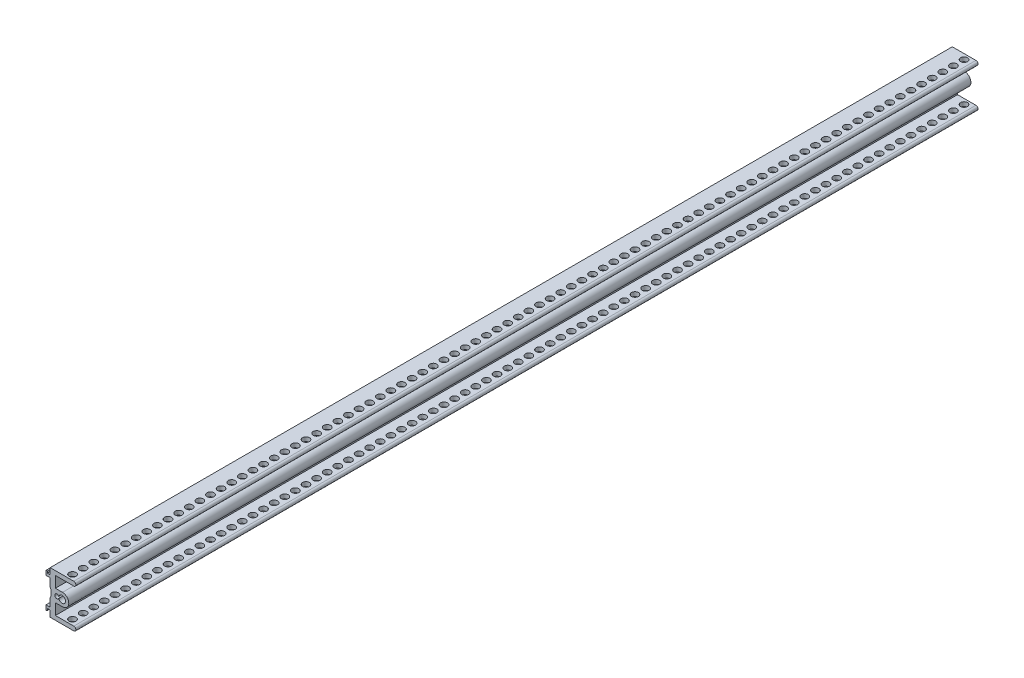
from build123d import *

# Parameters (mm, degrees)
EXTRUDE_1_DEPTH     = 215.9
SKETCH_3_R          = 1.65
CUT_EXTRUDE_1_DEPTH = 2.5


with BuildPart() as part:
    # Sketch 1 → Extrude 1 (new, symmetric)
    with BuildSketch(Plane.XY):
        with BuildLine():
            Line((-4.15, 8.3), (-4.15, 3))
            Line((-4.15, 3), (-0.75, 3))
            ThreePointArc((-0.75, 3), (2.25, 0), (-0.75, -3))
            Line((-0.75, -3), (-4.15, -3))
            Line((-4.15, -3), (-4.15, -8.3))
            Line((-4.15, -8.3), (4.65, -8.3))
            ThreePointArc((4.65, -8.3), (5.65, -9.3), (4.65, -10.3))
            Line((4.65, -10.3), (-6.65, -10.3))
            Line((-6.65, -10.3), (-6.65, -7.3))
            Line((-6.65, -7.3), (-8.05, -7.3))
            Line((-8.05, -7.3), (-8.05, -8.078245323))
            ThreePointArc((-8.05, -8.078245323), (-8.35, -8.378245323), (-8.65, -8.078245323))
            Line((-8.65, -8.078245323), (-8.65, -6.1))
            Line((-8.65, -6.1), (-6.65, -6.1))
            Line((-6.65, -6.1), (-6.65, -2.088438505))
            Line((-6.65, -2.088438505), (-6.35, -1.488438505))
            Line((-6.35, -1.488438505), (-6.35, 1.511561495))
            Line((-6.35, 1.511561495), (-6.65, 2.111561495))
            Line((-6.65, 2.111561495), (-6.65, 6.1))
            Line((-6.65, 6.1), (-8.65, 6.1))
            Line((-8.65, 6.1), (-8.65, 8.078245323))
            ThreePointArc((-8.65, 8.078245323), (-8.35, 8.378245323), (-8.05, 8.078245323))
            Line((-8.05, 8.078245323), (-8.05, 7.3))
            Line((-8.05, 7.3), (-6.65, 7.3))
            Line((-6.65, 7.3), (-6.65, 10.3))
            Line((-6.65, 10.3), (4.65, 10.3))
            ThreePointArc((4.65, 10.3), (5.65, 9.3), (4.65, 8.3))
            Line((4.65, 8.3), (-4.15, 8.3))
        make_face()
        with BuildLine():
            ThreePointArc((-2.5445, -0.424346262), (0.7, 0), (-2.5445, 0.424346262))
            ThreePointArc((-2.5445, 0.424346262), (-4.45, 0), (-2.5445, -0.424346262))
        make_face(mode=Mode.SUBTRACT)
    extrude(amount=EXTRUDE_1_DEPTH, both=True)

    # Sketch 3 → Cut-Extrude 1 (cut)
    with BuildSketch(Plane.XZ.offset(10.3)):
        with Locations((1.5, 213.36)):
            Circle(SKETCH_3_R)
        with Locations((1.5, 208.28)):
            Circle(SKETCH_3_R)
        with Locations((1.5, 203.2)):
            Circle(SKETCH_3_R)
        with Locations((1.5, 198.12)):
            Circle(SKETCH_3_R)
        with Locations((1.5, 193.04)):
            Circle(SKETCH_3_R)
        with Locations((1.5, 187.96)):
            Circle(SKETCH_3_R)
        with Locations((1.5, 182.88)):
            Circle(SKETCH_3_R)
        with Locations((1.5, 177.8)):
            Circle(SKETCH_3_R)
        with Locations((1.5, 172.72)):
            Circle(SKETCH_3_R)
        with Locations((1.5, 167.64)):
            Circle(SKETCH_3_R)
        with Locations((1.5, 162.56)):
            Circle(SKETCH_3_R)
        with Locations((1.5, 157.48)):
            Circle(SKETCH_3_R)
        with Locations((1.5, 152.4)):
            Circle(SKETCH_3_R)
        with Locations((1.5, 147.32)):
            Circle(SKETCH_3_R)
        with Locations((1.5, 142.24)):
            Circle(SKETCH_3_R)
        with Locations((1.5, 137.16)):
            Circle(SKETCH_3_R)
        with Locations((1.5, 132.08)):
            Circle(SKETCH_3_R)
        with Locations((1.5, 127)):
            Circle(SKETCH_3_R)
        with Locations((1.5, 121.92)):
            Circle(SKETCH_3_R)
        with Locations((1.5, 116.84)):
            Circle(SKETCH_3_R)
        with Locations((1.5, 111.76)):
            Circle(SKETCH_3_R)
        with Locations((1.5, 106.68)):
            Circle(SKETCH_3_R)
        with Locations((1.5, 101.6)):
            Circle(SKETCH_3_R)
        with Locations((1.5, 96.52)):
            Circle(SKETCH_3_R)
        with Locations((1.5, 91.44)):
            Circle(SKETCH_3_R)
        with Locations((1.5, 86.36)):
            Circle(SKETCH_3_R)
        with Locations((1.5, 81.28)):
            Circle(SKETCH_3_R)
        with Locations((1.5, 76.2)):
            Circle(SKETCH_3_R)
        with Locations((1.5, 71.12)):
            Circle(SKETCH_3_R)
        with Locations((1.5, 66.04)):
            Circle(SKETCH_3_R)
        with Locations((1.5, 60.96)):
            Circle(SKETCH_3_R)
        with Locations((1.5, 55.88)):
            Circle(SKETCH_3_R)
        with Locations((1.5, 50.8)):
            Circle(SKETCH_3_R)
        with Locations((1.5, 45.72)):
            Circle(SKETCH_3_R)
        with Locations((1.5, 40.64)):
            Circle(SKETCH_3_R)
        with Locations((1.5, 35.56)):
            Circle(SKETCH_3_R)
        with Locations((1.5, 30.48)):
            Circle(SKETCH_3_R)
        with Locations((1.5, 25.4)):
            Circle(SKETCH_3_R)
        with Locations((1.5, 20.32)):
            Circle(SKETCH_3_R)
        with Locations((1.5, 15.24)):
            Circle(SKETCH_3_R)
        with Locations((1.5, 10.16)):
            Circle(SKETCH_3_R)
        with Locations((1.5, 5.08)):
            Circle(SKETCH_3_R)
        with Locations((1.5, 0)):
            Circle(SKETCH_3_R)
        with Locations((1.5, -5.08)):
            Circle(SKETCH_3_R)
        with Locations((1.5, -10.16)):
            Circle(SKETCH_3_R)
        with Locations((1.5, -15.24)):
            Circle(SKETCH_3_R)
        with Locations((1.5, -20.32)):
            Circle(SKETCH_3_R)
        with Locations((1.5, -25.4)):
            Circle(SKETCH_3_R)
        with Locations((1.5, -30.48)):
            Circle(SKETCH_3_R)
        with Locations((1.5, -35.56)):
            Circle(SKETCH_3_R)
        with Locations((1.5, -40.64)):
            Circle(SKETCH_3_R)
        with Locations((1.5, -45.72)):
            Circle(SKETCH_3_R)
        with Locations((1.5, -50.8)):
            Circle(SKETCH_3_R)
        with Locations((1.5, -55.88)):
            Circle(SKETCH_3_R)
        with Locations((1.5, -60.96)):
            Circle(SKETCH_3_R)
        with Locations((1.5, -66.04)):
            Circle(SKETCH_3_R)
        with Locations((1.5, -71.12)):
            Circle(SKETCH_3_R)
        with Locations((1.5, -76.2)):
            Circle(SKETCH_3_R)
        with Locations((1.5, -81.28)):
            Circle(SKETCH_3_R)
        with Locations((1.5, -86.36)):
            Circle(SKETCH_3_R)
        with Locations((1.5, -91.44)):
            Circle(SKETCH_3_R)
        with Locations((1.5, -96.52)):
            Circle(SKETCH_3_R)
        with Locations((1.5, -101.6)):
            Circle(SKETCH_3_R)
        with Locations((1.5, -106.68)):
            Circle(SKETCH_3_R)
        with Locations((1.5, -111.76)):
            Circle(SKETCH_3_R)
        with Locations((1.5, -116.84)):
            Circle(SKETCH_3_R)
        with Locations((1.5, -121.92)):
            Circle(SKETCH_3_R)
        with Locations((1.5, -127)):
            Circle(SKETCH_3_R)
        with Locations((1.5, -132.08)):
            Circle(SKETCH_3_R)
        with Locations((1.5, -137.16)):
            Circle(SKETCH_3_R)
        with Locations((1.5, -142.24)):
            Circle(SKETCH_3_R)
        with Locations((1.5, -147.32)):
            Circle(SKETCH_3_R)
        with Locations((1.5, -152.4)):
            Circle(SKETCH_3_R)
        with Locations((1.5, -157.48)):
            Circle(SKETCH_3_R)
        with Locations((1.5, -162.56)):
            Circle(SKETCH_3_R)
        with Locations((1.5, -167.64)):
            Circle(SKETCH_3_R)
        with Locations((1.5, -172.72)):
            Circle(SKETCH_3_R)
        with Locations((1.5, -177.8)):
            Circle(SKETCH_3_R)
        with Locations((1.5, -182.88)):
            Circle(SKETCH_3_R)
        with Locations((1.5, -187.96)):
            Circle(SKETCH_3_R)
        with Locations((1.5, -193.04)):
            Circle(SKETCH_3_R)
        with Locations((1.5, -198.12)):
            Circle(SKETCH_3_R)
        with Locations((1.5, -203.2)):
            Circle(SKETCH_3_R)
        with Locations((1.5, -208.28)):
            Circle(SKETCH_3_R)
        with Locations((1.5, -213.36)):
            Circle(SKETCH_3_R)
    cut_extrude_1 = extrude(amount=-CUT_EXTRUDE_1_DEPTH, mode=Mode.SUBTRACT)

    # Mirror 1: Cut-Extrude 1 across plane
    add(cut_extrude_1.mirror(Plane.ZX), mode=Mode.SUBTRACT)


solid = part.part
